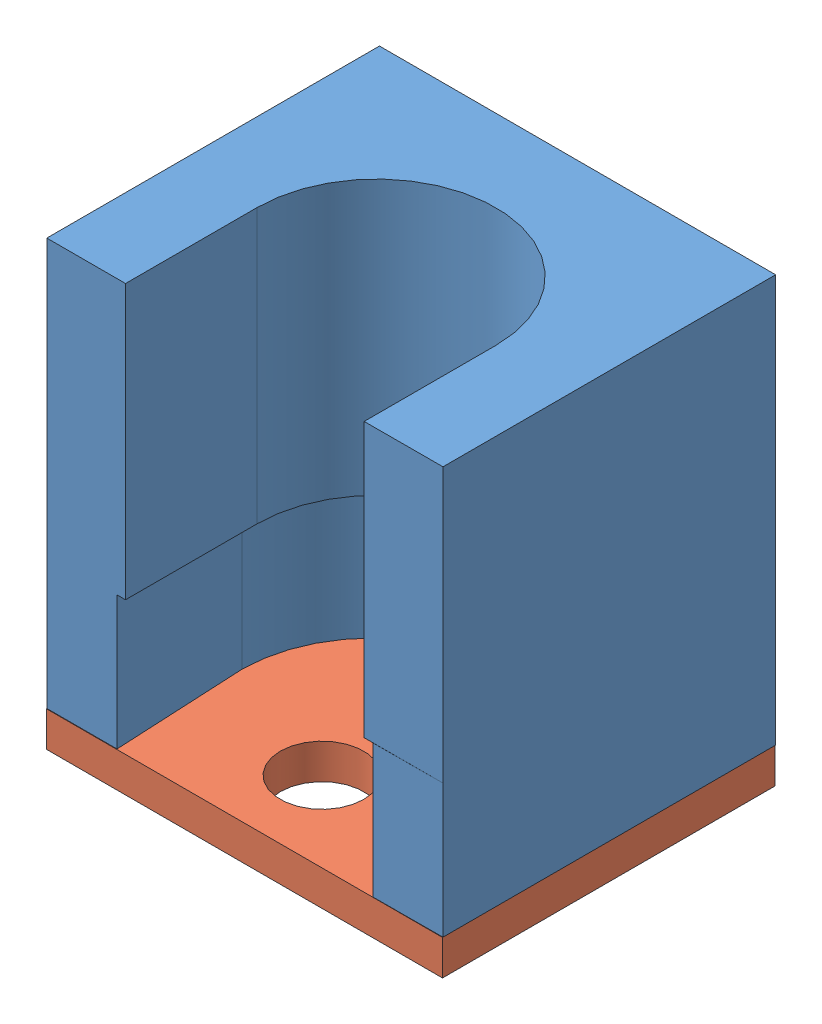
SolidWorks assembly Assem3.SLDASM, configuration Default (file format 9000). Lengths in mm.
Overall size (56.41 63 47.44).
2 component instances, 2 part files, 2 mates.
Components (placement in the parent):
- motor angle-2: motor angle.SLDPRT [Default] at (-30.21 98.5521 -41.9756) x (1 0 0) z (0 1 0) size (56.41 47.4 58)
- Part2-1: Part2.SLDPRT [Default] at (-36.225 93.5521 -35.1101) x (1 0 0) z (0 1 0) size (56.41 47.36 5)
Mates (geometry in assembly coordinates):
- Coincident2: coincident: plane of motor angle-2 through (-44.8719 98.5521 -34.1557) normal (0 -1 0); plane of Part2-1 through (-36.4694 98.5521 -35.1101) normal (0 1 0)
- Coincident3: coincident aligned: plane of motor angle-2 through (-16.199 117.5521 -62.8286) normal (1 0 0); plane of Part2-1 through (-16.199 98.5521 -62.7532) normal (1 0 0)
